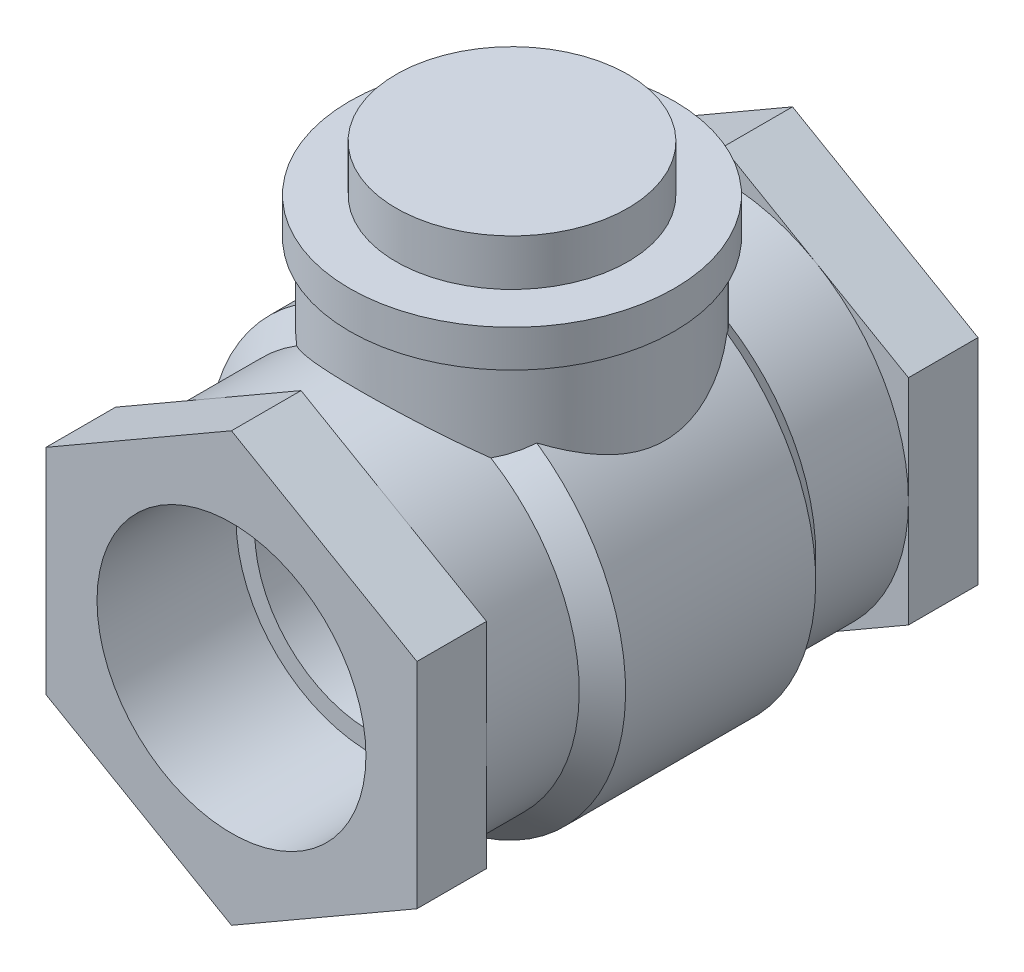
from build123d import *

# Parameters (mm, degrees)
ESQUISSE2_OUTSIDE_W     = 139.224
ESQUISSE2_OUTSIDE_H     = 139.224
ENL_V_MAT_EXTRU_1_DEPTH = 15
ESQUISSE3_OUTSIDE_W     = 139.224
ESQUISSE3_OUTSIDE_H     = 139.224
ENL_V_MAT_EXTRU_3_DEPTH = 15


with BuildPart() as part:
    # Esquisse1 → R_volution1 (revolve)
    with BuildSketch(Plane(origin=(0, 0, 0), x_dir=(1, 0, 0), z_dir=(0, 1, 0)), mode=Mode.PRIVATE) as r_volution1_sk:
        Polygon((29, 60.5), (29, 30.5), (25, 30.5), (25, -30.5), (29, -30.5), (29, -60.5), (50, -60.5), (50, -45.5), (40, -45.5), (40, -25.5), (45, -20.5), (45, 20.5), (40, 25.5), (40, 45.5), (50, 45.5), (50, 60.5), align=None)
    revolve(r_volution1_sk.sketch.rotate(Axis((0, 0, -91), (0, 0, 1)), 180), axis=Axis((0, 0, -91), (0, 0, 1)))

    # Esquisse2 outside → Enl_v. mat.-Extru.1 (cut)
    with BuildSketch(Plane.XY.offset(60.5)):
        Rectangle(ESQUISSE2_OUTSIDE_W, ESQUISSE2_OUTSIDE_H)
        Polygon((40, -23.094010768), (40, 23.094010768), (0, 46.188021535), (-40, 23.094010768), (-40, -23.094010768), (0, -46.188021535), align=None, mode=Mode.SUBTRACT)
    extrude(amount=-ENL_V_MAT_EXTRU_1_DEPTH, mode=Mode.SUBTRACT)

    # Esquisse3 outside → Enl_v. mat.-Extru.3 (cut)
    with BuildSketch(Plane(origin=(0, 0, -60.5), x_dir=(-1, 0, 0), z_dir=(0, 0, -1))):
        Rectangle(ESQUISSE3_OUTSIDE_W, ESQUISSE3_OUTSIDE_H)
        Polygon((40, -23.094010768), (40, 23.094010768), (0, 46.188021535), (-40, 23.094010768), (-40, -23.094010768), (0, -46.188021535), align=None, mode=Mode.SUBTRACT)
    extrude(amount=-ENL_V_MAT_EXTRU_3_DEPTH, mode=Mode.SUBTRACT)

    # Esquisse4 → R_volution2 (revolve)
    with BuildSketch(Plane.XY, mode=Mode.PRIVATE) as r_volution2_sk:
        Polygon((0, 70), (25, 70), (25, 60), (35, 60), (35, 52), (33, 52), (33, 30), (0, 30), align=None)
    revolve(r_volution2_sk.sketch.rotate(Axis((0, 0, 0), (0, 1, 0)), 90), axis=Axis((0, 0, 0), (0, 1, 0)))


solid = part.part
